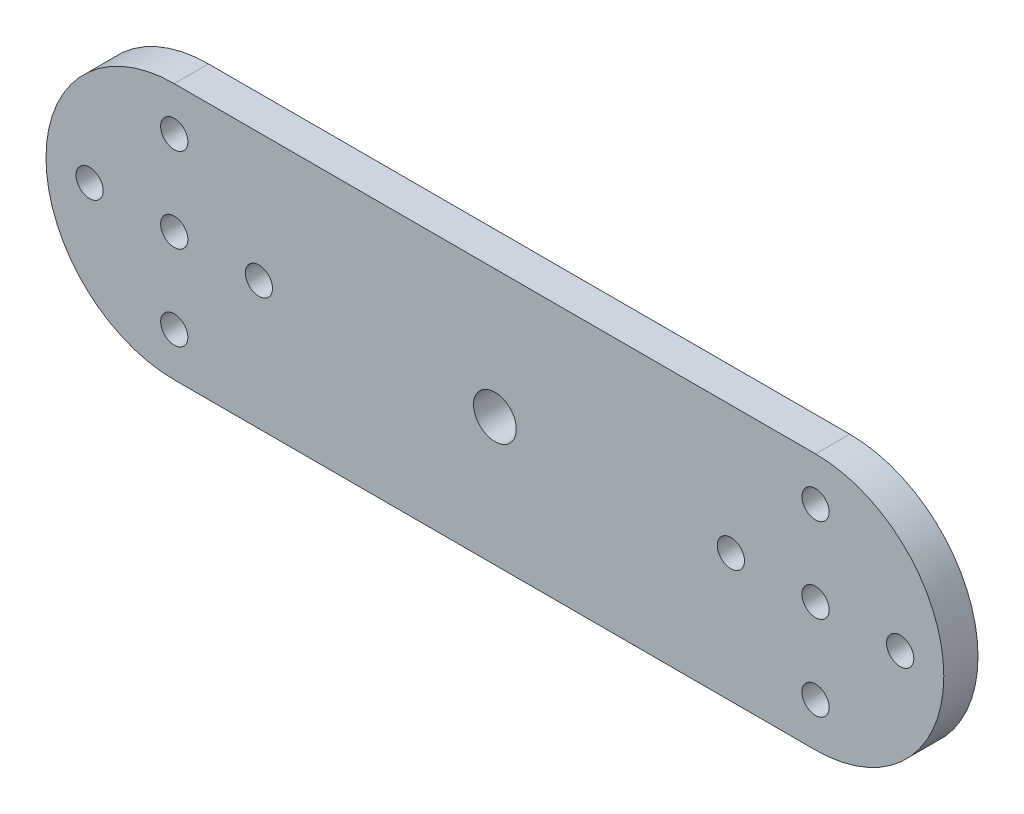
ISO-10303-21;
HEADER;
FILE_DESCRIPTION(('STEP AP214'),'2;1');
FILE_NAME('part.step','',(''),(''),'','','');
FILE_SCHEMA(('AUTOMOTIVE_DESIGN { 1 0 10303 214 1 1 1 1 }'));
ENDSEC;
DATA;
#1=APPLICATION_CONTEXT('core data for automotive mechanical design processes');
#2=APPLICATION_PROTOCOL_DEFINITION('international standard','automotive_design',2000,#1);
#3=PRODUCT_CONTEXT('',#1,'mechanical');
#4=PRODUCT('Part','Part','',(#3));
#5=PRODUCT_RELATED_PRODUCT_CATEGORY('part','',(#4));
#6=PRODUCT_DEFINITION_FORMATION('','',#4);
#7=PRODUCT_DEFINITION_CONTEXT('part definition',#1,'design');
#8=PRODUCT_DEFINITION('design','',#6,#7);
#9=PRODUCT_DEFINITION_SHAPE('','',#8);
#10=(LENGTH_UNIT() NAMED_UNIT(*) SI_UNIT(.MILLI.,.METRE.));
#11=(NAMED_UNIT(*) PLANE_ANGLE_UNIT() SI_UNIT($,.RADIAN.));
#12=(NAMED_UNIT(*) SI_UNIT($,.STERADIAN.) SOLID_ANGLE_UNIT());
#13=UNCERTAINTY_MEASURE_WITH_UNIT(LENGTH_MEASURE(1.E-05),#10,'distance_accuracy_value','');
#14=(GEOMETRIC_REPRESENTATION_CONTEXT(3) GLOBAL_UNCERTAINTY_ASSIGNED_CONTEXT((#13)) GLOBAL_UNIT_ASSIGNED_CONTEXT((#10,
#11,#12)) REPRESENTATION_CONTEXT('',''));
#15=CARTESIAN_POINT('',(0.,0.,0.));
#16=DIRECTION('',(0.,0.,1.));
#17=DIRECTION('',(1.,0.,0.));
#18=AXIS2_PLACEMENT_3D('',#15,#16,#17);
#19=CARTESIAN_POINT('',(-37.5,0.,4.));
#20=DIRECTION('',(0.,0.,1.));
#21=DIRECTION('',(1.,0.,0.));
#22=AXIS2_PLACEMENT_3D('',#19,#20,#21);
#23=PLANE('',#22);
#24=CARTESIAN_POINT('',(37.5,9.89999999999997,4.));
#25=DIRECTION('',(0.,0.,1.));
#26=DIRECTION('',(1.,0.,0.));
#27=AXIS2_PLACEMENT_3D('',#24,#25,#26);
#28=CIRCLE('',#27,1.59000000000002);
#29=CARTESIAN_POINT('',(39.09,9.89999999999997,4.));
#30=VERTEX_POINT('',#29);
#31=EDGE_CURVE('E162',#30,#30,#28,.T.);
#32=ORIENTED_EDGE('',*,*,#31,.F.);
#33=EDGE_LOOP('',(#32));
#34=FACE_BOUND('',#33,.T.);
#35=CARTESIAN_POINT('',(37.5,-9.90000000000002,4.));
#36=DIRECTION('',(0.,0.,1.));
#37=DIRECTION('',(1.,0.,0.));
#38=AXIS2_PLACEMENT_3D('',#35,#36,#37);
#39=CIRCLE('',#38,1.59);
#40=CARTESIAN_POINT('',(39.09,-9.90000000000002,4.));
#41=VERTEX_POINT('',#40);
#42=EDGE_CURVE('E150',#41,#41,#39,.T.);
#43=ORIENTED_EDGE('',*,*,#42,.F.);
#44=EDGE_LOOP('',(#43));
#45=FACE_BOUND('',#44,.T.);
#46=CARTESIAN_POINT('',(-37.5,-9.89999999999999,4.));
#47=DIRECTION('',(0.,0.,1.));
#48=DIRECTION('',(1.,0.,0.));
#49=AXIS2_PLACEMENT_3D('',#46,#47,#48);
#50=CIRCLE('',#49,1.59000000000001);
#51=CARTESIAN_POINT('',(-35.91,-9.89999999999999,4.));
#52=VERTEX_POINT('',#51);
#53=EDGE_CURVE('E138',#52,#52,#50,.T.);
#54=ORIENTED_EDGE('',*,*,#53,.F.);
#55=EDGE_LOOP('',(#54));
#56=FACE_BOUND('',#55,.T.);
#57=CARTESIAN_POINT('',(-37.5,9.9,4.));
#58=DIRECTION('',(0.,0.,1.));
#59=DIRECTION('',(1.,0.,0.));
#60=AXIS2_PLACEMENT_3D('',#57,#58,#59);
#61=CIRCLE('',#60,1.59);
#62=CARTESIAN_POINT('',(-35.91,9.9,4.));
#63=VERTEX_POINT('',#62);
#64=EDGE_CURVE('E126',#63,#63,#61,.T.);
#65=ORIENTED_EDGE('',*,*,#64,.F.);
#66=EDGE_LOOP('',(#65));
#67=FACE_BOUND('',#66,.T.);
#68=CARTESIAN_POINT('',(37.5,0.,4.));
#69=DIRECTION('',(0.,0.,1.));
#70=DIRECTION('',(1.,0.,0.));
#71=AXIS2_PLACEMENT_3D('',#68,#69,#70);
#72=CIRCLE('',#71,1.59);
#73=CARTESIAN_POINT('',(39.09,0.,4.));
#74=VERTEX_POINT('',#73);
#75=EDGE_CURVE('E114',#74,#74,#72,.T.);
#76=ORIENTED_EDGE('',*,*,#75,.F.);
#77=EDGE_LOOP('',(#76));
#78=FACE_BOUND('',#77,.T.);
#79=CARTESIAN_POINT('',(-37.5,0.,4.));
#80=DIRECTION('',(0.,0.,1.));
#81=DIRECTION('',(1.,0.,0.));
#82=AXIS2_PLACEMENT_3D('',#79,#80,#81);
#83=CIRCLE('',#82,15.);
#84=CARTESIAN_POINT('',(-37.5,15.,4.));
#85=VERTEX_POINT('',#84);
#86=CARTESIAN_POINT('',(-37.5,-15.,4.));
#87=VERTEX_POINT('',#86);
#88=EDGE_CURVE('E84',#85,#87,#83,.T.);
#89=ORIENTED_EDGE('',*,*,#88,.T.);
#90=DIRECTION('',(1.,0.,0.));
#91=VECTOR('',#90,1.);
#92=CARTESIAN_POINT('',(-37.5,-15.,4.));
#93=LINE('',#92,#91);
#94=CARTESIAN_POINT('',(37.5,-15.,4.));
#95=VERTEX_POINT('',#94);
#96=EDGE_CURVE('E79',#87,#95,#93,.T.);
#97=ORIENTED_EDGE('',*,*,#96,.T.);
#98=CARTESIAN_POINT('',(37.5,0.,4.));
#99=DIRECTION('',(0.,0.,1.));
#100=DIRECTION('',(1.,0.,0.));
#101=AXIS2_PLACEMENT_3D('',#98,#99,#100);
#102=CIRCLE('',#101,15.);
#103=CARTESIAN_POINT('',(37.5,15.,4.));
#104=VERTEX_POINT('',#103);
#105=EDGE_CURVE('E82',#95,#104,#102,.T.);
#106=ORIENTED_EDGE('',*,*,#105,.T.);
#107=DIRECTION('',(-1.,0.,0.));
#108=VECTOR('',#107,1.);
#109=CARTESIAN_POINT('',(-37.5,15.,4.));
#110=LINE('',#109,#108);
#111=EDGE_CURVE('E49',#104,#85,#110,.T.);
#112=ORIENTED_EDGE('',*,*,#111,.T.);
#113=EDGE_LOOP('',(#89,#97,#106,#112));
#114=FACE_BOUND('',#113,.T.);
#115=CARTESIAN_POINT('',(-37.5,0.,4.));
#116=DIRECTION('',(0.,0.,1.));
#117=DIRECTION('',(1.,0.,0.));
#118=AXIS2_PLACEMENT_3D('',#115,#116,#117);
#119=CIRCLE('',#118,1.59);
#120=CARTESIAN_POINT('',(-35.91,0.,4.));
#121=VERTEX_POINT('',#120);
#122=EDGE_CURVE('E99',#121,#121,#119,.T.);
#123=ORIENTED_EDGE('',*,*,#122,.F.);
#124=EDGE_LOOP('',(#123));
#125=FACE_BOUND('',#124,.T.);
#126=CARTESIAN_POINT('',(-47.4,0.,4.));
#127=DIRECTION('',(0.,0.,1.));
#128=DIRECTION('',(1.,0.,0.));
#129=AXIS2_PLACEMENT_3D('',#126,#127,#128);
#130=CIRCLE('',#129,1.59);
#131=CARTESIAN_POINT('',(-45.81,0.,4.));
#132=VERTEX_POINT('',#131);
#133=EDGE_CURVE('E120',#132,#132,#130,.T.);
#134=ORIENTED_EDGE('',*,*,#133,.F.);
#135=EDGE_LOOP('',(#134));
#136=FACE_BOUND('',#135,.T.);
#137=CARTESIAN_POINT('',(-27.6,0.,4.));
#138=DIRECTION('',(0.,0.,1.));
#139=DIRECTION('',(1.,0.,0.));
#140=AXIS2_PLACEMENT_3D('',#137,#138,#139);
#141=CIRCLE('',#140,1.59);
#142=CARTESIAN_POINT('',(-26.01,0.,4.));
#143=VERTEX_POINT('',#142);
#144=EDGE_CURVE('E132',#143,#143,#141,.T.);
#145=ORIENTED_EDGE('',*,*,#144,.F.);
#146=EDGE_LOOP('',(#145));
#147=FACE_BOUND('',#146,.T.);
#148=CARTESIAN_POINT('',(47.4,0.,4.));
#149=DIRECTION('',(0.,0.,1.));
#150=DIRECTION('',(1.,0.,0.));
#151=AXIS2_PLACEMENT_3D('',#148,#149,#150);
#152=CIRCLE('',#151,1.59);
#153=CARTESIAN_POINT('',(48.99,0.,4.));
#154=VERTEX_POINT('',#153);
#155=EDGE_CURVE('E144',#154,#154,#152,.T.);
#156=ORIENTED_EDGE('',*,*,#155,.F.);
#157=EDGE_LOOP('',(#156));
#158=FACE_BOUND('',#157,.T.);
#159=CARTESIAN_POINT('',(27.6,0.,4.));
#160=DIRECTION('',(0.,0.,1.));
#161=DIRECTION('',(1.,0.,0.));
#162=AXIS2_PLACEMENT_3D('',#159,#160,#161);
#163=CIRCLE('',#162,1.59);
#164=CARTESIAN_POINT('',(29.19,0.,4.));
#165=VERTEX_POINT('',#164);
#166=EDGE_CURVE('E156',#165,#165,#163,.T.);
#167=ORIENTED_EDGE('',*,*,#166,.F.);
#168=EDGE_LOOP('',(#167));
#169=FACE_BOUND('',#168,.T.);
#170=CARTESIAN_POINT('',(0.,0.,4.));
#171=DIRECTION('',(0.,0.,1.));
#172=DIRECTION('',(1.,0.,0.));
#173=AXIS2_PLACEMENT_3D('',#170,#171,#172);
#174=CIRCLE('',#173,2.5);
#175=CARTESIAN_POINT('',(2.5,0.,4.));
#176=VERTEX_POINT('',#175);
#177=EDGE_CURVE('E168',#176,#176,#174,.T.);
#178=ORIENTED_EDGE('',*,*,#177,.F.);
#179=EDGE_LOOP('',(#178));
#180=FACE_BOUND('',#179,.T.);
#181=ADVANCED_FACE('F32',(#34,#45,#56,#67,#78,#114,#125,#136,#147,#158,#169,#180),#23,.T.);
#182=CARTESIAN_POINT('',(-37.5,0.,0.));
#183=DIRECTION('',(0.,0.,1.));
#184=DIRECTION('',(1.,0.,0.));
#185=AXIS2_PLACEMENT_3D('',#182,#183,#184);
#186=PLANE('',#185);
#187=CARTESIAN_POINT('',(37.5,9.89999999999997,0.));
#188=DIRECTION('',(0.,0.,1.));
#189=DIRECTION('',(1.,0.,0.));
#190=AXIS2_PLACEMENT_3D('',#187,#188,#189);
#191=CIRCLE('',#190,1.59000000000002);
#192=CARTESIAN_POINT('',(39.09,9.89999999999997,0.));
#193=VERTEX_POINT('',#192);
#194=EDGE_CURVE('E165',#193,#193,#191,.T.);
#195=ORIENTED_EDGE('',*,*,#194,.T.);
#196=EDGE_LOOP('',(#195));
#197=FACE_BOUND('',#196,.T.);
#198=CARTESIAN_POINT('',(37.5,-9.90000000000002,0.));
#199=DIRECTION('',(0.,0.,1.));
#200=DIRECTION('',(1.,0.,0.));
#201=AXIS2_PLACEMENT_3D('',#198,#199,#200);
#202=CIRCLE('',#201,1.59);
#203=CARTESIAN_POINT('',(39.09,-9.90000000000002,0.));
#204=VERTEX_POINT('',#203);
#205=EDGE_CURVE('E153',#204,#204,#202,.T.);
#206=ORIENTED_EDGE('',*,*,#205,.T.);
#207=EDGE_LOOP('',(#206));
#208=FACE_BOUND('',#207,.T.);
#209=CARTESIAN_POINT('',(-37.5,-9.89999999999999,0.));
#210=DIRECTION('',(0.,0.,1.));
#211=DIRECTION('',(1.,0.,0.));
#212=AXIS2_PLACEMENT_3D('',#209,#210,#211);
#213=CIRCLE('',#212,1.59000000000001);
#214=CARTESIAN_POINT('',(-35.91,-9.89999999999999,0.));
#215=VERTEX_POINT('',#214);
#216=EDGE_CURVE('E141',#215,#215,#213,.T.);
#217=ORIENTED_EDGE('',*,*,#216,.T.);
#218=EDGE_LOOP('',(#217));
#219=FACE_BOUND('',#218,.T.);
#220=CARTESIAN_POINT('',(-37.5,9.9,0.));
#221=DIRECTION('',(0.,0.,1.));
#222=DIRECTION('',(1.,0.,0.));
#223=AXIS2_PLACEMENT_3D('',#220,#221,#222);
#224=CIRCLE('',#223,1.59);
#225=CARTESIAN_POINT('',(-35.91,9.9,0.));
#226=VERTEX_POINT('',#225);
#227=EDGE_CURVE('E129',#226,#226,#224,.T.);
#228=ORIENTED_EDGE('',*,*,#227,.T.);
#229=EDGE_LOOP('',(#228));
#230=FACE_BOUND('',#229,.T.);
#231=CARTESIAN_POINT('',(37.5,0.,0.));
#232=DIRECTION('',(0.,0.,1.));
#233=DIRECTION('',(1.,0.,0.));
#234=AXIS2_PLACEMENT_3D('',#231,#232,#233);
#235=CIRCLE('',#234,1.59);
#236=CARTESIAN_POINT('',(39.09,0.,0.));
#237=VERTEX_POINT('',#236);
#238=EDGE_CURVE('E117',#237,#237,#235,.T.);
#239=ORIENTED_EDGE('',*,*,#238,.T.);
#240=EDGE_LOOP('',(#239));
#241=FACE_BOUND('',#240,.T.);
#242=CARTESIAN_POINT('',(-37.5,0.,0.));
#243=DIRECTION('',(0.,0.,1.));
#244=DIRECTION('',(1.,0.,0.));
#245=AXIS2_PLACEMENT_3D('',#242,#243,#244);
#246=CIRCLE('',#245,15.);
#247=CARTESIAN_POINT('',(-37.5,15.,0.));
#248=VERTEX_POINT('',#247);
#249=CARTESIAN_POINT('',(-37.5,-15.,0.));
#250=VERTEX_POINT('',#249);
#251=EDGE_CURVE('E96',#248,#250,#246,.T.);
#252=ORIENTED_EDGE('',*,*,#251,.F.);
#253=DIRECTION('',(-1.,0.,0.));
#254=VECTOR('',#253,1.);
#255=CARTESIAN_POINT('',(-37.5,15.,0.));
#256=LINE('',#255,#254);
#257=CARTESIAN_POINT('',(37.5,15.,0.));
#258=VERTEX_POINT('',#257);
#259=EDGE_CURVE('E72',#258,#248,#256,.T.);
#260=ORIENTED_EDGE('',*,*,#259,.F.);
#261=CARTESIAN_POINT('',(37.5,0.,0.));
#262=DIRECTION('',(0.,0.,1.));
#263=DIRECTION('',(1.,0.,0.));
#264=AXIS2_PLACEMENT_3D('',#261,#262,#263);
#265=CIRCLE('',#264,15.);
#266=CARTESIAN_POINT('',(37.5,-15.,0.));
#267=VERTEX_POINT('',#266);
#268=EDGE_CURVE('E66',#267,#258,#265,.T.);
#269=ORIENTED_EDGE('',*,*,#268,.F.);
#270=DIRECTION('',(1.,0.,0.));
#271=VECTOR('',#270,1.);
#272=CARTESIAN_POINT('',(-37.5,-15.,0.));
#273=LINE('',#272,#271);
#274=EDGE_CURVE('E88',#250,#267,#273,.T.);
#275=ORIENTED_EDGE('',*,*,#274,.F.);
#276=EDGE_LOOP('',(#252,#260,#269,#275));
#277=FACE_BOUND('',#276,.T.);
#278=CARTESIAN_POINT('',(-37.5,0.,0.));
#279=DIRECTION('',(0.,0.,1.));
#280=DIRECTION('',(1.,0.,0.));
#281=AXIS2_PLACEMENT_3D('',#278,#279,#280);
#282=CIRCLE('',#281,1.59);
#283=CARTESIAN_POINT('',(-35.91,0.,0.));
#284=VERTEX_POINT('',#283);
#285=EDGE_CURVE('E111',#284,#284,#282,.T.);
#286=ORIENTED_EDGE('',*,*,#285,.T.);
#287=EDGE_LOOP('',(#286));
#288=FACE_BOUND('',#287,.T.);
#289=CARTESIAN_POINT('',(-47.4,0.,0.));
#290=DIRECTION('',(0.,0.,1.));
#291=DIRECTION('',(1.,0.,0.));
#292=AXIS2_PLACEMENT_3D('',#289,#290,#291);
#293=CIRCLE('',#292,1.59);
#294=CARTESIAN_POINT('',(-45.81,0.,0.));
#295=VERTEX_POINT('',#294);
#296=EDGE_CURVE('E123',#295,#295,#293,.T.);
#297=ORIENTED_EDGE('',*,*,#296,.T.);
#298=EDGE_LOOP('',(#297));
#299=FACE_BOUND('',#298,.T.);
#300=CARTESIAN_POINT('',(-27.6,0.,0.));
#301=DIRECTION('',(0.,0.,1.));
#302=DIRECTION('',(1.,0.,0.));
#303=AXIS2_PLACEMENT_3D('',#300,#301,#302);
#304=CIRCLE('',#303,1.59);
#305=CARTESIAN_POINT('',(-26.01,0.,0.));
#306=VERTEX_POINT('',#305);
#307=EDGE_CURVE('E135',#306,#306,#304,.T.);
#308=ORIENTED_EDGE('',*,*,#307,.T.);
#309=EDGE_LOOP('',(#308));
#310=FACE_BOUND('',#309,.T.);
#311=CARTESIAN_POINT('',(47.4,0.,0.));
#312=DIRECTION('',(0.,0.,1.));
#313=DIRECTION('',(1.,0.,0.));
#314=AXIS2_PLACEMENT_3D('',#311,#312,#313);
#315=CIRCLE('',#314,1.59);
#316=CARTESIAN_POINT('',(48.99,0.,0.));
#317=VERTEX_POINT('',#316);
#318=EDGE_CURVE('E147',#317,#317,#315,.T.);
#319=ORIENTED_EDGE('',*,*,#318,.T.);
#320=EDGE_LOOP('',(#319));
#321=FACE_BOUND('',#320,.T.);
#322=CARTESIAN_POINT('',(27.6,0.,0.));
#323=DIRECTION('',(0.,0.,1.));
#324=DIRECTION('',(1.,0.,0.));
#325=AXIS2_PLACEMENT_3D('',#322,#323,#324);
#326=CIRCLE('',#325,1.59);
#327=CARTESIAN_POINT('',(29.19,0.,0.));
#328=VERTEX_POINT('',#327);
#329=EDGE_CURVE('E159',#328,#328,#326,.T.);
#330=ORIENTED_EDGE('',*,*,#329,.T.);
#331=EDGE_LOOP('',(#330));
#332=FACE_BOUND('',#331,.T.);
#333=CARTESIAN_POINT('',(0.,0.,0.));
#334=DIRECTION('',(0.,0.,1.));
#335=DIRECTION('',(1.,0.,0.));
#336=AXIS2_PLACEMENT_3D('',#333,#334,#335);
#337=CIRCLE('',#336,2.5);
#338=CARTESIAN_POINT('',(2.5,0.,0.));
#339=VERTEX_POINT('',#338);
#340=EDGE_CURVE('E171',#339,#339,#337,.T.);
#341=ORIENTED_EDGE('',*,*,#340,.T.);
#342=EDGE_LOOP('',(#341));
#343=FACE_BOUND('',#342,.T.);
#344=ADVANCED_FACE('F107',(#197,#208,#219,#230,#241,#277,#288,#299,#310,#321,#332,#343),#186,.F.);
#345=CARTESIAN_POINT('',(-37.5,0.,4.));
#346=DIRECTION('',(0.,0.,-1.));
#347=DIRECTION('',(-1.,0.,0.));
#348=AXIS2_PLACEMENT_3D('',#345,#346,#347);
#349=CYLINDRICAL_SURFACE('',#348,15.);
#350=ORIENTED_EDGE('',*,*,#251,.T.);
#351=DIRECTION('',(0.,0.,-1.));
#352=VECTOR('',#351,1.);
#353=CARTESIAN_POINT('',(-37.5,-15.,4.));
#354=LINE('',#353,#352);
#355=EDGE_CURVE('E11',#87,#250,#354,.T.);
#356=ORIENTED_EDGE('',*,*,#355,.F.);
#357=ORIENTED_EDGE('',*,*,#88,.F.);
#358=DIRECTION('',(0.,0.,-1.));
#359=VECTOR('',#358,1.);
#360=CARTESIAN_POINT('',(-37.5,15.,4.));
#361=LINE('',#360,#359);
#362=EDGE_CURVE('E92',#85,#248,#361,.T.);
#363=ORIENTED_EDGE('',*,*,#362,.T.);
#364=EDGE_LOOP('',(#350,#356,#357,#363));
#365=FACE_BOUND('',#364,.T.);
#366=ADVANCED_FACE('F34',(#365),#349,.T.);
#367=CARTESIAN_POINT('',(-37.5,-15.,4.));
#368=DIRECTION('',(0.,1.,0.));
#369=DIRECTION('',(0.,0.,1.));
#370=AXIS2_PLACEMENT_3D('',#367,#368,#369);
#371=PLANE('',#370);
#372=ORIENTED_EDGE('',*,*,#274,.T.);
#373=DIRECTION('',(0.,0.,-1.));
#374=VECTOR('',#373,1.);
#375=CARTESIAN_POINT('',(37.5,-15.,4.));
#376=LINE('',#375,#374);
#377=EDGE_CURVE('E41',#95,#267,#376,.T.);
#378=ORIENTED_EDGE('',*,*,#377,.F.);
#379=ORIENTED_EDGE('',*,*,#96,.F.);
#380=ORIENTED_EDGE('',*,*,#355,.T.);
#381=EDGE_LOOP('',(#372,#378,#379,#380));
#382=FACE_BOUND('',#381,.T.);
#383=ADVANCED_FACE('F87',(#382),#371,.F.);
#384=CARTESIAN_POINT('',(37.5,0.,4.));
#385=DIRECTION('',(0.,0.,-1.));
#386=DIRECTION('',(-1.,0.,0.));
#387=AXIS2_PLACEMENT_3D('',#384,#385,#386);
#388=CYLINDRICAL_SURFACE('',#387,15.);
#389=ORIENTED_EDGE('',*,*,#268,.T.);
#390=DIRECTION('',(0.,0.,-1.));
#391=VECTOR('',#390,1.);
#392=CARTESIAN_POINT('',(37.5,15.,4.));
#393=LINE('',#392,#391);
#394=EDGE_CURVE('E89',#104,#258,#393,.T.);
#395=ORIENTED_EDGE('',*,*,#394,.F.);
#396=ORIENTED_EDGE('',*,*,#105,.F.);
#397=ORIENTED_EDGE('',*,*,#377,.T.);
#398=EDGE_LOOP('',(#389,#395,#396,#397));
#399=FACE_BOUND('',#398,.T.);
#400=ADVANCED_FACE('F90',(#399),#388,.T.);
#401=CARTESIAN_POINT('',(-37.5,15.,4.));
#402=DIRECTION('',(0.,-1.,0.));
#403=DIRECTION('',(0.,0.,-1.));
#404=AXIS2_PLACEMENT_3D('',#401,#402,#403);
#405=PLANE('',#404);
#406=ORIENTED_EDGE('',*,*,#259,.T.);
#407=ORIENTED_EDGE('',*,*,#362,.F.);
#408=ORIENTED_EDGE('',*,*,#111,.F.);
#409=ORIENTED_EDGE('',*,*,#394,.T.);
#410=EDGE_LOOP('',(#406,#407,#408,#409));
#411=FACE_BOUND('',#410,.T.);
#412=ADVANCED_FACE('F104',(#411),#405,.F.);
#413=CARTESIAN_POINT('',(-37.5,0.,4.));
#414=DIRECTION('',(0.,0.,-1.));
#415=DIRECTION('',(-1.,0.,0.));
#416=AXIS2_PLACEMENT_3D('',#413,#414,#415);
#417=CYLINDRICAL_SURFACE('',#416,1.59);
#418=ORIENTED_EDGE('',*,*,#122,.T.);
#419=EDGE_LOOP('',(#418));
#420=FACE_BOUND('',#419,.T.);
#421=ORIENTED_EDGE('',*,*,#285,.F.);
#422=EDGE_LOOP('',(#421));
#423=FACE_BOUND('',#422,.T.);
#424=ADVANCED_FACE('F191',(#420,#423),#417,.F.);
#425=CARTESIAN_POINT('',(37.5,0.,4.));
#426=DIRECTION('',(0.,0.,-1.));
#427=DIRECTION('',(-1.,0.,0.));
#428=AXIS2_PLACEMENT_3D('',#425,#426,#427);
#429=CYLINDRICAL_SURFACE('',#428,1.59);
#430=ORIENTED_EDGE('',*,*,#75,.T.);
#431=EDGE_LOOP('',(#430));
#432=FACE_BOUND('',#431,.T.);
#433=ORIENTED_EDGE('',*,*,#238,.F.);
#434=EDGE_LOOP('',(#433));
#435=FACE_BOUND('',#434,.T.);
#436=ADVANCED_FACE('F237',(#432,#435),#429,.F.);
#437=CARTESIAN_POINT('',(-47.4,0.,4.));
#438=DIRECTION('',(0.,0.,-1.));
#439=DIRECTION('',(-1.,0.,0.));
#440=AXIS2_PLACEMENT_3D('',#437,#438,#439);
#441=CYLINDRICAL_SURFACE('',#440,1.59);
#442=ORIENTED_EDGE('',*,*,#133,.T.);
#443=EDGE_LOOP('',(#442));
#444=FACE_BOUND('',#443,.T.);
#445=ORIENTED_EDGE('',*,*,#296,.F.);
#446=EDGE_LOOP('',(#445));
#447=FACE_BOUND('',#446,.T.);
#448=ADVANCED_FACE('F245',(#444,#447),#441,.F.);
#449=CARTESIAN_POINT('',(-37.5,9.9,4.));
#450=DIRECTION('',(0.,0.,-1.));
#451=DIRECTION('',(-1.,0.,0.));
#452=AXIS2_PLACEMENT_3D('',#449,#450,#451);
#453=CYLINDRICAL_SURFACE('',#452,1.59);
#454=ORIENTED_EDGE('',*,*,#64,.T.);
#455=EDGE_LOOP('',(#454));
#456=FACE_BOUND('',#455,.T.);
#457=ORIENTED_EDGE('',*,*,#227,.F.);
#458=EDGE_LOOP('',(#457));
#459=FACE_BOUND('',#458,.T.);
#460=ADVANCED_FACE('F253',(#456,#459),#453,.F.);
#461=CARTESIAN_POINT('',(-27.6,0.,4.));
#462=DIRECTION('',(0.,0.,-1.));
#463=DIRECTION('',(-1.,0.,0.));
#464=AXIS2_PLACEMENT_3D('',#461,#462,#463);
#465=CYLINDRICAL_SURFACE('',#464,1.59);
#466=ORIENTED_EDGE('',*,*,#144,.T.);
#467=EDGE_LOOP('',(#466));
#468=FACE_BOUND('',#467,.T.);
#469=ORIENTED_EDGE('',*,*,#307,.F.);
#470=EDGE_LOOP('',(#469));
#471=FACE_BOUND('',#470,.T.);
#472=ADVANCED_FACE('F262',(#468,#471),#465,.F.);
#473=CARTESIAN_POINT('',(-37.5,-9.89999999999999,4.));
#474=DIRECTION('',(0.,0.,-1.));
#475=DIRECTION('',(-1.,0.,0.));
#476=AXIS2_PLACEMENT_3D('',#473,#474,#475);
#477=CYLINDRICAL_SURFACE('',#476,1.59000000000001);
#478=ORIENTED_EDGE('',*,*,#53,.T.);
#479=EDGE_LOOP('',(#478));
#480=FACE_BOUND('',#479,.T.);
#481=ORIENTED_EDGE('',*,*,#216,.F.);
#482=EDGE_LOOP('',(#481));
#483=FACE_BOUND('',#482,.T.);
#484=ADVANCED_FACE('F271',(#480,#483),#477,.F.);
#485=CARTESIAN_POINT('',(47.4,0.,4.));
#486=DIRECTION('',(0.,0.,-1.));
#487=DIRECTION('',(-1.,0.,0.));
#488=AXIS2_PLACEMENT_3D('',#485,#486,#487);
#489=CYLINDRICAL_SURFACE('',#488,1.59);
#490=ORIENTED_EDGE('',*,*,#155,.T.);
#491=EDGE_LOOP('',(#490));
#492=FACE_BOUND('',#491,.T.);
#493=ORIENTED_EDGE('',*,*,#318,.F.);
#494=EDGE_LOOP('',(#493));
#495=FACE_BOUND('',#494,.T.);
#496=ADVANCED_FACE('F280',(#492,#495),#489,.F.);
#497=CARTESIAN_POINT('',(37.5,-9.90000000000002,4.));
#498=DIRECTION('',(0.,0.,-1.));
#499=DIRECTION('',(-1.,0.,0.));
#500=AXIS2_PLACEMENT_3D('',#497,#498,#499);
#501=CYLINDRICAL_SURFACE('',#500,1.59);
#502=ORIENTED_EDGE('',*,*,#42,.T.);
#503=EDGE_LOOP('',(#502));
#504=FACE_BOUND('',#503,.T.);
#505=ORIENTED_EDGE('',*,*,#205,.F.);
#506=EDGE_LOOP('',(#505));
#507=FACE_BOUND('',#506,.T.);
#508=ADVANCED_FACE('F289',(#504,#507),#501,.F.);
#509=CARTESIAN_POINT('',(27.6,0.,4.));
#510=DIRECTION('',(0.,0.,-1.));
#511=DIRECTION('',(-1.,0.,0.));
#512=AXIS2_PLACEMENT_3D('',#509,#510,#511);
#513=CYLINDRICAL_SURFACE('',#512,1.59);
#514=ORIENTED_EDGE('',*,*,#166,.T.);
#515=EDGE_LOOP('',(#514));
#516=FACE_BOUND('',#515,.T.);
#517=ORIENTED_EDGE('',*,*,#329,.F.);
#518=EDGE_LOOP('',(#517));
#519=FACE_BOUND('',#518,.T.);
#520=ADVANCED_FACE('F298',(#516,#519),#513,.F.);
#521=CARTESIAN_POINT('',(37.5,9.89999999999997,4.));
#522=DIRECTION('',(0.,0.,-1.));
#523=DIRECTION('',(-1.,0.,0.));
#524=AXIS2_PLACEMENT_3D('',#521,#522,#523);
#525=CYLINDRICAL_SURFACE('',#524,1.59000000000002);
#526=ORIENTED_EDGE('',*,*,#31,.T.);
#527=EDGE_LOOP('',(#526));
#528=FACE_BOUND('',#527,.T.);
#529=ORIENTED_EDGE('',*,*,#194,.F.);
#530=EDGE_LOOP('',(#529));
#531=FACE_BOUND('',#530,.T.);
#532=ADVANCED_FACE('F307',(#528,#531),#525,.F.);
#533=CARTESIAN_POINT('',(0.,0.,4.));
#534=DIRECTION('',(0.,0.,-1.));
#535=DIRECTION('',(-1.,0.,0.));
#536=AXIS2_PLACEMENT_3D('',#533,#534,#535);
#537=CYLINDRICAL_SURFACE('',#536,2.5);
#538=ORIENTED_EDGE('',*,*,#177,.T.);
#539=EDGE_LOOP('',(#538));
#540=FACE_BOUND('',#539,.T.);
#541=ORIENTED_EDGE('',*,*,#340,.F.);
#542=EDGE_LOOP('',(#541));
#543=FACE_BOUND('',#542,.T.);
#544=ADVANCED_FACE('F177',(#540,#543),#537,.F.);
#545=CLOSED_SHELL('',(#181,#344,#366,#383,#400,#412,#424,#436,#448,#460,#472,#484,#496,#508,
#520,#532,#544));
#546=MANIFOLD_SOLID_BREP('B2',#545);
#547=ADVANCED_BREP_SHAPE_REPRESENTATION('',(#18,#546),#14);
#548=SHAPE_DEFINITION_REPRESENTATION(#9,#547);
ENDSEC;
END-ISO-10303-21;
